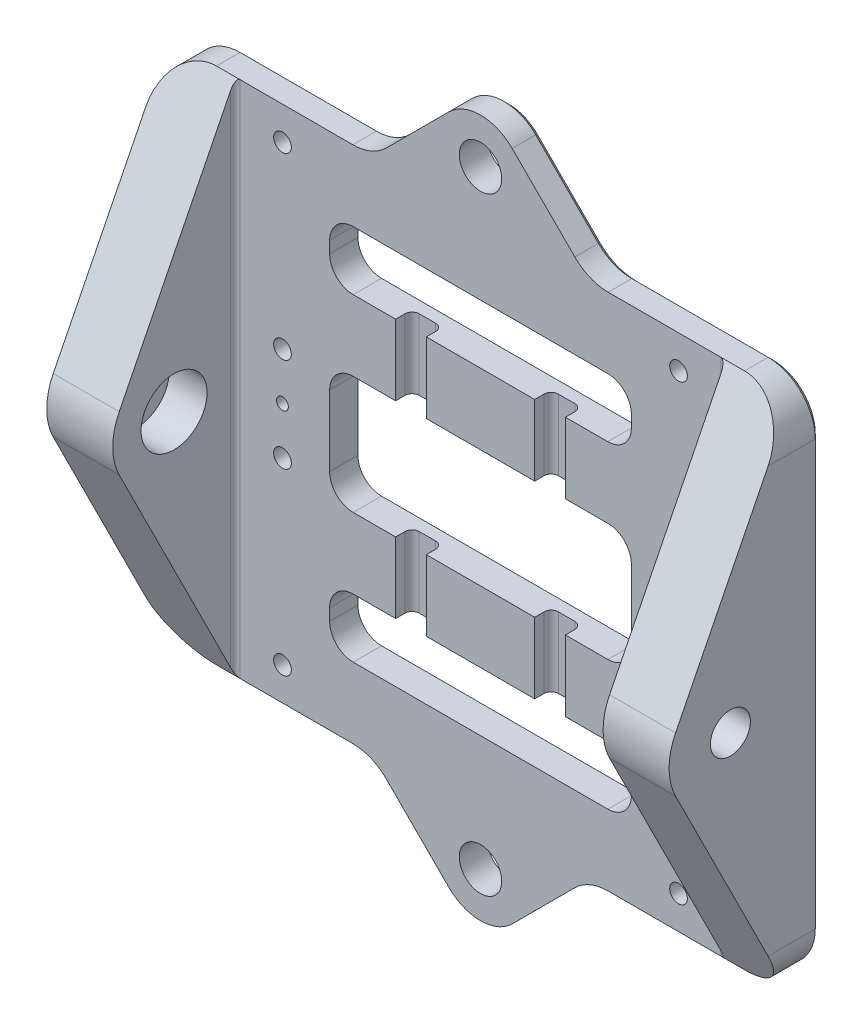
from build123d import *

# Parameters (mm, degrees)
SKETCH1_W                   = 104
SKETCH1_H                   = 110
SKETCH1_R                   = 1.875
SKETCH1_R_2                 = 1.25
SKETCH1_R_3                 = 4.5
BASE_PLATE_DEPTH            = 6
WEIGHT_RED_REACH            = 92.642
SKETCH3_W                   = 64
SKETCH3_H                   = 25
SKETCH3_H_2                 = 12.5
SKETCH4_W                   = 6.5
SKETCH4_H                   = 55
RAIL_CUT_DEPTH              = 3.5
RAIL_FILLET_R               = 1.5
SKETCH1_4_W                 = 14
SKETCH1_4_H                 = 110
WALL_EXTRUDE_DEPTH          = 32
WALL_CUTS_REACH             = 144.913
SKETCH5_R                   = 4.25
WALL_CUTS_DIRECTION_2_REACH = 144.913
BOLT_HEAD_CUS_DEPTH         = 8
BOLT_HEAD_CUS_DEPTH_BACK    = 112
SKETCH5_5_R                 = 7
SKETCH5_5_R_2               = 4.25
FILLET1_R                   = 5
FILLET4_R                   = 10
CHAMFER1_SIZE               = 1
FILLET5_R                   = 1


with BuildPart() as part:
    # Sketch1 → Base Plate (new body)
    # profile 1 of 3: a face of its own
    with BuildSketch(Plane.XY):
        Rectangle(SKETCH1_W, SKETCH1_H)
        with Locations((42, -48)):
            Circle(SKETCH1_R, mode=Mode.SUBTRACT)
        with Locations((42, -10)):
            Circle(SKETCH1_R, mode=Mode.SUBTRACT)
        with Locations((42, 48)):
            Circle(SKETCH1_R, mode=Mode.SUBTRACT)
        with Locations((42, 10)):
            Circle(SKETCH1_R, mode=Mode.SUBTRACT)
        with Locations((42, 0)):
            Circle(SKETCH1_R_2, mode=Mode.SUBTRACT)
        with Locations((-42, -48)):
            Circle(SKETCH1_R, mode=Mode.SUBTRACT)
        with Locations((-42, -10)):
            Circle(SKETCH1_R, mode=Mode.SUBTRACT)
        with Locations((-42, 0)):
            Circle(SKETCH1_R_2, mode=Mode.SUBTRACT)
        with Locations((-42, 10)):
            Circle(SKETCH1_R, mode=Mode.SUBTRACT)
        with Locations((-42, 48)):
            Circle(SKETCH1_R, mode=Mode.SUBTRACT)
    # profile 2 of 3: a face of its own
    with BuildSketch(Plane.XY):
        with BuildLine():
            Line((-6.717514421, 71.217514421), (-22.935028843, 55))
            Line((-22.935028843, 55), (22.935028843, 55))
            Line((22.935028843, 55), (6.717514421, 71.217514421))
            ThreePointArc((6.717514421, 71.217514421), (0, 74), (-6.717514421, 71.217514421))
        make_face()
        with Locations((0, 64.5)):
            Circle(SKETCH1_R_3, mode=Mode.SUBTRACT)
    # profile 3 of 3: a face of its own
    with BuildSketch(Plane.XY):
        with BuildLine():
            Line((22.935028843, -55), (-22.935028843, -55))
            Line((-22.935028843, -55), (-6.717514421, -71.217514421))
            ThreePointArc((-6.717514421, -71.217514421), (0, -74), (6.717514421, -71.217514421))
            Line((6.717514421, -71.217514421), (22.935028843, -55))
        make_face()
        with Locations((0, -64.5)):
            Circle(SKETCH1_R_3, mode=Mode.SUBTRACT)
    extrude(amount=BASE_PLATE_DEPTH)

    # Sketch3 → Weight Red (cut, up to next)
    with BuildSketch(Plane.XY.offset(6), mode=Mode.PRIVATE) as weight_red_sk1:
        Rectangle(SKETCH3_W, SKETCH3_H)
    weight_red_tool1 = extrude(weight_red_sk1.sketch, amount=-WEIGHT_RED_REACH, mode=Mode.PRIVATE) & part.part
    # Sketch3 → Weight Red (cut, up to next)
    with BuildSketch(Plane.XY.offset(6), mode=Mode.PRIVATE) as weight_red_sk2:
        with Locations((0, 33.75)):
            Rectangle(SKETCH3_W, SKETCH3_H_2)
    weight_red_tool2 = extrude(weight_red_sk2.sketch, amount=-WEIGHT_RED_REACH, mode=Mode.PRIVATE) & part.part
    # Sketch3 → Weight Red (cut, up to next)
    with BuildSketch(Plane.XY.offset(6), mode=Mode.PRIVATE) as weight_red_sk3:
        with Locations((0, -33.75)):
            Rectangle(SKETCH3_W, SKETCH3_H_2)
    weight_red_tool3 = extrude(weight_red_sk3.sketch, amount=-WEIGHT_RED_REACH, mode=Mode.PRIVATE) & part.part
    add(weight_red_tool1.solids().sort_by_distance((0, 0, 6))[0], mode=Mode.SUBTRACT)
    add(weight_red_tool2.solids().sort_by_distance((0, 33.75, 6))[0], mode=Mode.SUBTRACT)
    add(weight_red_tool3.solids().sort_by_distance((0, -33.75, 6))[0], mode=Mode.SUBTRACT)

    # Sketch4 → Rail Cut (cut)
    with BuildSketch(Plane.XY.offset(6)):
        with Locations((-14.75, 0)):
            Rectangle(SKETCH4_W, SKETCH4_H)
        with Locations((14.75, 0)):
            Rectangle(SKETCH4_W, SKETCH4_H)
    extrude(amount=-RAIL_CUT_DEPTH, mode=Mode.SUBTRACT)

    # Rail Fillet
    rail_fillet_edges = [part.edges().sort_by_distance(p)[0] for p in [
        (-18, 20, 2.5),
        (-18, -20, 2.5),
        (-11.5, 20, 2.5),
        (-11.5, -20, 2.5),
        (11.5, 20, 2.5),
        (11.5, -20, 2.5),
        (18, 20, 2.5),
        (18, -20, 2.5),
    ]]
    fillet(rail_fillet_edges, radius=RAIL_FILLET_R)

    # Sketch1_4 → Wall Extrude (add)
    with BuildSketch(Plane.XY):
        with Locations((-59, 0)):
            Rectangle(SKETCH1_4_W, SKETCH1_4_H)
        with Locations((59, 0)):
            Rectangle(SKETCH1_4_W, SKETCH1_4_H)
    extrude(amount=WALL_EXTRUDE_DEPTH)

    # Sketch5 → Wall Cuts (cut, up to next)
    with BuildSketch(Plane(origin=(52, 0, 0), x_dir=(0, 0, -1), z_dir=(1, 0, 0)), mode=Mode.PRIVATE) as wall_cuts_sk1:
        with BuildLine():
            ThreePointArc((-32, -1.9e-08), (-31.651399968, 2.990330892), (-30.624295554, 5.82028804))
            Line((-30.624295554, 5.82028804), (-6, 55))
            Line((-6, 55), (-32, 55))
            Line((-32, 55), (-32, -1.9e-08))
        make_face()
    wall_cuts_tool1 = extrude(wall_cuts_sk1.sketch, amount=-WALL_CUTS_REACH, mode=Mode.PRIVATE) & part.part
    # Sketch5 → Wall Cuts (cut, up to next)
    with BuildSketch(Plane(origin=(52, 0, 0), x_dir=(0, 0, -1), z_dir=(1, 0, 0)), mode=Mode.PRIVATE) as wall_cuts_sk2:
        with BuildLine():
            ThreePointArc((-30.624295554, -5.82028804), (-31.651399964, -2.99033091), (-32, -1.9e-08))
            Line((-32, -1.9e-08), (-32, -55))
            Line((-32, -55), (-6, -55))
            Line((-6, -55), (-30.624295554, -5.82028804))
        make_face()
    wall_cuts_tool2 = extrude(wall_cuts_sk2.sketch, amount=-WALL_CUTS_REACH, mode=Mode.PRIVATE) & part.part
    # Sketch5 → Wall Cuts (cut, up to next)
    with BuildSketch(Plane(origin=(52, 0, 0), x_dir=(0, 0, -1), z_dir=(1, 0, 0)), mode=Mode.PRIVATE) as wall_cuts_sk3:
        with Locations(Location((-19, 0, 0), (0, 0, 180))):
            Circle(SKETCH5_R)
    wall_cuts_tool3 = extrude(wall_cuts_sk3.sketch, amount=-WALL_CUTS_REACH, mode=Mode.PRIVATE) & part.part
    add(wall_cuts_tool1.solids().sort_by_distance((52, 37.65396, 23.34227))[0], mode=Mode.SUBTRACT)
    add(wall_cuts_tool2.solids().sort_by_distance((52, -37.65396, 23.34227))[0], mode=Mode.SUBTRACT)
    add(wall_cuts_tool3.solids().sort_by_distance((52, 0, 19))[0], mode=Mode.SUBTRACT)

    # Sketch5 → Wall Cuts direction 2 (cut, up to next)
    with BuildSketch(Plane(origin=(52, 0, 0), x_dir=(0, 0, -1), z_dir=(1, 0, 0)), mode=Mode.PRIVATE) as wall_cuts_direction_2_sk1:
        with BuildLine():
            ThreePointArc((-32, -1.9e-08), (-31.651399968, 2.990330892), (-30.624295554, 5.82028804))
            Line((-30.624295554, 5.82028804), (-6, 55))
            Line((-6, 55), (-32, 55))
            Line((-32, 55), (-32, -1.9e-08))
        make_face()
    wall_cuts_direction_2_tool1 = extrude(wall_cuts_direction_2_sk1.sketch, amount=WALL_CUTS_DIRECTION_2_REACH, mode=Mode.PRIVATE) & part.part
    # Sketch5 → Wall Cuts direction 2 (cut, up to next)
    with BuildSketch(Plane(origin=(52, 0, 0), x_dir=(0, 0, -1), z_dir=(1, 0, 0)), mode=Mode.PRIVATE) as wall_cuts_direction_2_sk2:
        with BuildLine():
            ThreePointArc((-30.624295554, -5.82028804), (-31.651399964, -2.99033091), (-32, -1.9e-08))
            Line((-32, -1.9e-08), (-32, -55))
            Line((-32, -55), (-6, -55))
            Line((-6, -55), (-30.624295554, -5.82028804))
        make_face()
    wall_cuts_direction_2_tool2 = extrude(wall_cuts_direction_2_sk2.sketch, amount=WALL_CUTS_DIRECTION_2_REACH, mode=Mode.PRIVATE) & part.part
    # Sketch5 → Wall Cuts direction 2 (cut, up to next)
    with BuildSketch(Plane(origin=(52, 0, 0), x_dir=(0, 0, -1), z_dir=(1, 0, 0)), mode=Mode.PRIVATE) as wall_cuts_direction_2_sk3:
        with Locations(Location((-19, 0, 0), (0, 0, 180))):
            Circle(SKETCH5_R)
    wall_cuts_direction_2_tool3 = extrude(wall_cuts_direction_2_sk3.sketch, amount=WALL_CUTS_DIRECTION_2_REACH, mode=Mode.PRIVATE) & part.part
    add(wall_cuts_direction_2_tool1.solids().sort_by_distance((52, 37.65396, 23.34227))[0], mode=Mode.SUBTRACT)
    add(wall_cuts_direction_2_tool2.solids().sort_by_distance((52, -37.65396, 23.34227))[0], mode=Mode.SUBTRACT)
    add(wall_cuts_direction_2_tool3.solids().sort_by_distance((52, 0, 19))[0], mode=Mode.SUBTRACT)

    # Sketch5_5 → Bolt Head Cus (cut, two sides: drawn at the far end of the back side and taken through both)
    with BuildSketch(Plane(origin=(52, 0, 0), x_dir=(0, 0, -1), z_dir=(1, 0, 0)).offset(-BOLT_HEAD_CUS_DEPTH_BACK)):
        with Locations((-19, 0)):
            Circle(SKETCH5_5_R)
        with Locations(Location((-19, 0, 0), (0, 0, 180))):
            Circle(SKETCH5_5_R_2, mode=Mode.SUBTRACT)
    extrude(amount=BOLT_HEAD_CUS_DEPTH + BOLT_HEAD_CUS_DEPTH_BACK, mode=Mode.SUBTRACT)

    # Fillet1
    fillet1_edges = [part.edges().sort_by_distance(p)[0] for p in [
        (-32, -40, 3),
        (-32, -27.5, 3),
        (32, -27.5, 3),
        (32, -40, 3),
        (-32, -12.5, 3),
        (-32, 12.5, 3),
        (32, 12.5, 3),
        (32, -12.5, 3),
        (-32, 27.5, 3),
        (-32, 40, 3),
        (32, 40, 3),
        (32, 27.5, 3),
    ]]
    fillet(fillet1_edges, radius=FILLET1_R)

    # Fillet4
    fillet4_edges = [part.edges().sort_by_distance(p)[0] for p in [
        (66, -55, 3),
        (66, 55, 3),
        (-66, 55, 3),
        (-66, -55, 3),
        (22.935028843, -55, 3),
        (-22.935028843, -55, 3),
        (22.935028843, 55, 3),
        (-22.935028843, 55, 3),
    ]]
    fillet(fillet4_edges, radius=FILLET4_R)

    # Chamfer1
    chamfer1_edges = [part.edges().sort_by_distance(p)[0] for p in [
        (13.361805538, -64.573223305, 0),
        (0, -74, 0),
        (0, 74, 0),
        (13.361805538, 64.573223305, 0),
        (66, 0, 0),
        (41.538582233, 55, 0),
        (41.538582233, -55, 0),
        (-13.361805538, -64.573223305, 0),
        (-41.538582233, -55, 0),
        (-66, 0, 0),
        (-41.538582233, 55, 0),
        (-13.361805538, 64.573223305, 0),
        (-63.071067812, -52.071067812, 0),
        (-63.071067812, 52.071067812, 0),
        (63.071067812, 52.071067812, 0),
        (63.071067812, -52.071067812, 0),
        (23.250330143, -55.761204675, 0),
        (-23.250330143, -55.761204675, 0),
        (23.250330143, 55.761204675, 0),
        (-23.250330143, 55.761204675, 0),
    ]]
    chamfer(chamfer1_edges, length=CHAMFER1_SIZE)

    # Fillet5
    fillet5_edges = [part.edges().sort_by_distance(p)[0] for p in [
        (52, 0, 6),
        (-52, 0, 6),
    ]]
    fillet(fillet5_edges, radius=FILLET5_R)


solid = part.part
